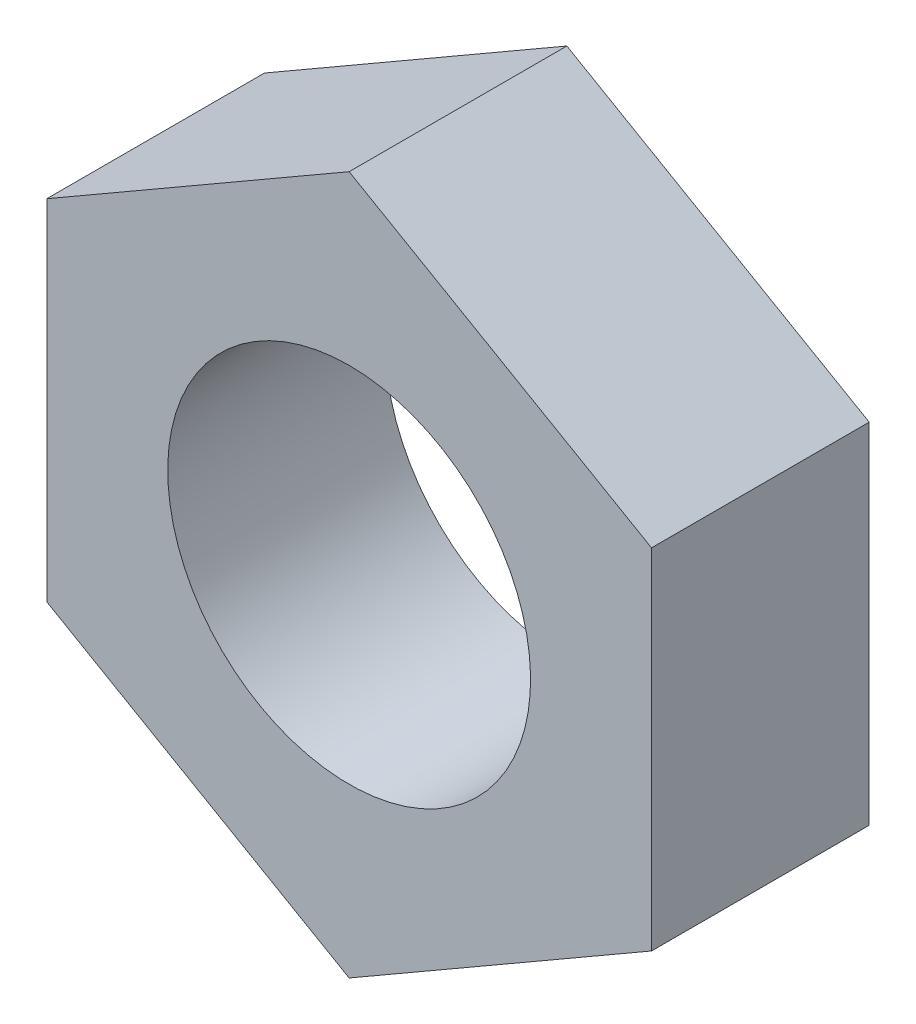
ISO-10303-21;
HEADER;
FILE_DESCRIPTION(('STEP AP214'),'2;1');
FILE_NAME('part.step','',(''),(''),'','','');
FILE_SCHEMA(('AUTOMOTIVE_DESIGN { 1 0 10303 214 1 1 1 1 }'));
ENDSEC;
DATA;
#1=APPLICATION_CONTEXT('core data for automotive mechanical design processes');
#2=APPLICATION_PROTOCOL_DEFINITION('international standard','automotive_design',2000,#1);
#3=PRODUCT_CONTEXT('',#1,'mechanical');
#4=PRODUCT('Part','Part','',(#3));
#5=PRODUCT_RELATED_PRODUCT_CATEGORY('part','',(#4));
#6=PRODUCT_DEFINITION_FORMATION('','',#4);
#7=PRODUCT_DEFINITION_CONTEXT('part definition',#1,'design');
#8=PRODUCT_DEFINITION('design','',#6,#7);
#9=PRODUCT_DEFINITION_SHAPE('','',#8);
#10=(LENGTH_UNIT() NAMED_UNIT(*) SI_UNIT(.MILLI.,.METRE.));
#11=(NAMED_UNIT(*) PLANE_ANGLE_UNIT() SI_UNIT($,.RADIAN.));
#12=(NAMED_UNIT(*) SI_UNIT($,.STERADIAN.) SOLID_ANGLE_UNIT());
#13=UNCERTAINTY_MEASURE_WITH_UNIT(LENGTH_MEASURE(1.E-05),#10,'distance_accuracy_value','');
#14=(GEOMETRIC_REPRESENTATION_CONTEXT(3) GLOBAL_UNCERTAINTY_ASSIGNED_CONTEXT((#13)) GLOBAL_UNIT_ASSIGNED_CONTEXT((#10,
#11,#12)) REPRESENTATION_CONTEXT('',''));
#15=CARTESIAN_POINT('',(0.,0.,0.));
#16=DIRECTION('',(0.,0.,1.));
#17=DIRECTION('',(1.,0.,0.));
#18=AXIS2_PLACEMENT_3D('',#15,#16,#17);
#19=CARTESIAN_POINT('',(5.,2.88675134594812,5.));
#20=DIRECTION('',(1.,0.,0.));
#21=DIRECTION('',(0.,0.,1.));
#22=AXIS2_PLACEMENT_3D('',#19,#20,#21);
#23=PLANE('',#22);
#24=DIRECTION('',(0.,1.,0.));
#25=VECTOR('',#24,1.);
#26=CARTESIAN_POINT('',(5.,2.88675134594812,3.6));
#27=LINE('',#26,#25);
#28=CARTESIAN_POINT('',(5.,-2.88675134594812,3.6));
#29=VERTEX_POINT('',#28);
#30=CARTESIAN_POINT('',(5.,2.88675134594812,3.6));
#31=VERTEX_POINT('',#30);
#32=EDGE_CURVE('E107',#29,#31,#27,.T.);
#33=ORIENTED_EDGE('',*,*,#32,.F.);
#34=DIRECTION('',(0.,0.,-1.));
#35=VECTOR('',#34,1.);
#36=CARTESIAN_POINT('',(5.,-2.88675134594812,5.));
#37=LINE('',#36,#35);
#38=CARTESIAN_POINT('',(5.,-2.88675134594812,0.));
#39=VERTEX_POINT('',#38);
#40=EDGE_CURVE('E39',#29,#39,#37,.T.);
#41=ORIENTED_EDGE('',*,*,#40,.T.);
#42=DIRECTION('',(0.,-1.,0.));
#43=VECTOR('',#42,1.);
#44=CARTESIAN_POINT('',(5.,2.88675134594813,0.));
#45=LINE('',#44,#43);
#46=CARTESIAN_POINT('',(5.,2.88675134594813,0.));
#47=VERTEX_POINT('',#46);
#48=EDGE_CURVE('E90',#47,#39,#45,.T.);
#49=ORIENTED_EDGE('',*,*,#48,.F.);
#50=DIRECTION('',(0.,0.,-1.));
#51=VECTOR('',#50,1.);
#52=CARTESIAN_POINT('',(5.,2.88675134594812,5.));
#53=LINE('',#52,#51);
#54=EDGE_CURVE('E9',#31,#47,#53,.T.);
#55=ORIENTED_EDGE('',*,*,#54,.F.);
#56=EDGE_LOOP('',(#33,#41,#49,#55));
#57=FACE_BOUND('',#56,.T.);
#58=ADVANCED_FACE('F14',(#57),#23,.T.);
#59=CARTESIAN_POINT('',(5.,2.88675134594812,5.));
#60=DIRECTION('',(-0.5,-0.86602540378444,0.));
#61=DIRECTION('',(0.86602540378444,-0.5,0.));
#62=AXIS2_PLACEMENT_3D('',#59,#60,#61);
#63=PLANE('',#62);
#64=DIRECTION('',(0.,0.,-1.));
#65=VECTOR('',#64,1.);
#66=CARTESIAN_POINT('',(0.,5.77350269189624,5.));
#67=LINE('',#66,#65);
#68=CARTESIAN_POINT('',(0.,5.77350269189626,3.6));
#69=VERTEX_POINT('',#68);
#70=CARTESIAN_POINT('',(0.,5.77350269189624,0.));
#71=VERTEX_POINT('',#70);
#72=EDGE_CURVE('E23',#69,#71,#67,.T.);
#73=ORIENTED_EDGE('',*,*,#72,.F.);
#74=DIRECTION('',(0.866025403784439,-0.5,0.));
#75=VECTOR('',#74,1.);
#76=CARTESIAN_POINT('',(5.,2.88675134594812,3.6));
#77=LINE('',#76,#75);
#78=EDGE_CURVE('E112',#69,#31,#77,.T.);
#79=ORIENTED_EDGE('',*,*,#78,.T.);
#80=ORIENTED_EDGE('',*,*,#54,.T.);
#81=DIRECTION('',(-0.86602540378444,0.5,0.));
#82=VECTOR('',#81,1.);
#83=CARTESIAN_POINT('',(5.,2.88675134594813,0.));
#84=LINE('',#83,#82);
#85=EDGE_CURVE('E85',#47,#71,#84,.T.);
#86=ORIENTED_EDGE('',*,*,#85,.T.);
#87=EDGE_LOOP('',(#73,#79,#80,#86));
#88=FACE_BOUND('',#87,.T.);
#89=ADVANCED_FACE('F16',(#88),#63,.F.);
#90=CARTESIAN_POINT('',(-5.,2.88675134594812,5.));
#91=DIRECTION('',(-0.5,0.86602540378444,0.));
#92=DIRECTION('',(-0.86602540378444,-0.5,0.));
#93=AXIS2_PLACEMENT_3D('',#90,#91,#92);
#94=PLANE('',#93);
#95=DIRECTION('',(-0.866025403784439,-0.5,0.));
#96=VECTOR('',#95,1.);
#97=CARTESIAN_POINT('',(-5.,2.88675134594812,3.6));
#98=LINE('',#97,#96);
#99=CARTESIAN_POINT('',(-5.,2.88675134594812,3.6));
#100=VERTEX_POINT('',#99);
#101=EDGE_CURVE('E99',#69,#100,#98,.T.);
#102=ORIENTED_EDGE('',*,*,#101,.F.);
#103=ORIENTED_EDGE('',*,*,#72,.T.);
#104=DIRECTION('',(0.86602540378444,0.5,0.));
#105=VECTOR('',#104,1.);
#106=CARTESIAN_POINT('',(-5.,2.88675134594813,0.));
#107=LINE('',#106,#105);
#108=CARTESIAN_POINT('',(-5.,2.88675134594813,0.));
#109=VERTEX_POINT('',#108);
#110=EDGE_CURVE('E83',#109,#71,#107,.T.);
#111=ORIENTED_EDGE('',*,*,#110,.F.);
#112=DIRECTION('',(0.,0.,-1.));
#113=VECTOR('',#112,1.);
#114=CARTESIAN_POINT('',(-5.,2.88675134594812,5.));
#115=LINE('',#114,#113);
#116=EDGE_CURVE('E68',#100,#109,#115,.T.);
#117=ORIENTED_EDGE('',*,*,#116,.F.);
#118=EDGE_LOOP('',(#102,#103,#111,#117));
#119=FACE_BOUND('',#118,.T.);
#120=ADVANCED_FACE('F96',(#119),#94,.T.);
#121=CARTESIAN_POINT('',(-5.,2.88675134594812,5.));
#122=DIRECTION('',(1.,0.,0.));
#123=DIRECTION('',(0.,0.,1.));
#124=AXIS2_PLACEMENT_3D('',#121,#122,#123);
#125=PLANE('',#124);
#126=DIRECTION('',(0.,0.,-1.));
#127=VECTOR('',#126,1.);
#128=CARTESIAN_POINT('',(-5.,-2.88675134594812,5.));
#129=LINE('',#128,#127);
#130=CARTESIAN_POINT('',(-5.,-2.88675134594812,3.6));
#131=VERTEX_POINT('',#130);
#132=CARTESIAN_POINT('',(-5.,-2.88675134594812,0.));
#133=VERTEX_POINT('',#132);
#134=EDGE_CURVE('E59',#131,#133,#129,.T.);
#135=ORIENTED_EDGE('',*,*,#134,.F.);
#136=DIRECTION('',(0.,1.,0.));
#137=VECTOR('',#136,1.);
#138=CARTESIAN_POINT('',(-5.,2.88675134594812,3.6));
#139=LINE('',#138,#137);
#140=EDGE_CURVE('E122',#131,#100,#139,.T.);
#141=ORIENTED_EDGE('',*,*,#140,.T.);
#142=ORIENTED_EDGE('',*,*,#116,.T.);
#143=DIRECTION('',(0.,-1.,0.));
#144=VECTOR('',#143,1.);
#145=CARTESIAN_POINT('',(-5.,2.88675134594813,0.));
#146=LINE('',#145,#144);
#147=EDGE_CURVE('E76',#109,#133,#146,.T.);
#148=ORIENTED_EDGE('',*,*,#147,.T.);
#149=EDGE_LOOP('',(#135,#141,#142,#148));
#150=FACE_BOUND('',#149,.T.);
#151=ADVANCED_FACE('F81',(#150),#125,.F.);
#152=CARTESIAN_POINT('',(-5.,-2.88675134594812,5.));
#153=DIRECTION('',(0.5,0.86602540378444,0.));
#154=DIRECTION('',(-0.86602540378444,0.5,0.));
#155=AXIS2_PLACEMENT_3D('',#152,#153,#154);
#156=PLANE('',#155);
#157=DIRECTION('',(0.,0.,-1.));
#158=VECTOR('',#157,1.);
#159=CARTESIAN_POINT('',(0.,-5.77350269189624,5.));
#160=LINE('',#159,#158);
#161=CARTESIAN_POINT('',(0.,-5.77350269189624,3.6));
#162=VERTEX_POINT('',#161);
#163=CARTESIAN_POINT('',(0.,-5.77350269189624,0.));
#164=VERTEX_POINT('',#163);
#165=EDGE_CURVE('E69',#162,#164,#160,.T.);
#166=ORIENTED_EDGE('',*,*,#165,.F.);
#167=DIRECTION('',(-0.866025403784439,0.5,0.));
#168=VECTOR('',#167,1.);
#169=CARTESIAN_POINT('',(-5.,-2.88675134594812,3.6));
#170=LINE('',#169,#168);
#171=EDGE_CURVE('E30',#162,#131,#170,.T.);
#172=ORIENTED_EDGE('',*,*,#171,.T.);
#173=ORIENTED_EDGE('',*,*,#134,.T.);
#174=DIRECTION('',(0.86602540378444,-0.5,0.));
#175=VECTOR('',#174,1.);
#176=CARTESIAN_POINT('',(-5.,-2.88675134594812,0.));
#177=LINE('',#176,#175);
#178=EDGE_CURVE('E63',#133,#164,#177,.T.);
#179=ORIENTED_EDGE('',*,*,#178,.T.);
#180=EDGE_LOOP('',(#166,#172,#173,#179));
#181=FACE_BOUND('',#180,.T.);
#182=ADVANCED_FACE('F62',(#181),#156,.F.);
#183=CARTESIAN_POINT('',(5.,-2.88675134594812,5.));
#184=DIRECTION('',(0.5,-0.86602540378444,0.));
#185=DIRECTION('',(0.86602540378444,0.5,0.));
#186=AXIS2_PLACEMENT_3D('',#183,#184,#185);
#187=PLANE('',#186);
#188=DIRECTION('',(0.866025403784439,0.5,0.));
#189=VECTOR('',#188,1.);
#190=CARTESIAN_POINT('',(5.,-2.88675134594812,3.6));
#191=LINE('',#190,#189);
#192=EDGE_CURVE('E120',#162,#29,#191,.T.);
#193=ORIENTED_EDGE('',*,*,#192,.F.);
#194=ORIENTED_EDGE('',*,*,#165,.T.);
#195=DIRECTION('',(-0.86602540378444,-0.5,0.));
#196=VECTOR('',#195,1.);
#197=CARTESIAN_POINT('',(5.,-2.88675134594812,0.));
#198=LINE('',#197,#196);
#199=EDGE_CURVE('E79',#39,#164,#198,.T.);
#200=ORIENTED_EDGE('',*,*,#199,.F.);
#201=ORIENTED_EDGE('',*,*,#40,.F.);
#202=EDGE_LOOP('',(#193,#194,#200,#201));
#203=FACE_BOUND('',#202,.T.);
#204=ADVANCED_FACE('F118',(#203),#187,.T.);
#205=CARTESIAN_POINT('',(5.,-8.66025403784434,0.));
#206=DIRECTION('',(0.,0.,1.));
#207=DIRECTION('',(0.,-1.,0.));
#208=AXIS2_PLACEMENT_3D('',#205,#206,#207);
#209=PLANE('',#208);
#210=CARTESIAN_POINT('',(0.,0.,0.));
#211=DIRECTION('',(0.,0.,-1.));
#212=DIRECTION('',(0.,1.,0.));
#213=AXIS2_PLACEMENT_3D('',#210,#211,#212);
#214=CIRCLE('',#213,3.);
#215=CARTESIAN_POINT('',(0.,3.,0.));
#216=VERTEX_POINT('',#215);
#217=EDGE_CURVE('E105',#216,#216,#214,.T.);
#218=ORIENTED_EDGE('',*,*,#217,.F.);
#219=EDGE_LOOP('',(#218));
#220=FACE_BOUND('',#219,.T.);
#221=ORIENTED_EDGE('',*,*,#48,.T.);
#222=ORIENTED_EDGE('',*,*,#199,.T.);
#223=ORIENTED_EDGE('',*,*,#178,.F.);
#224=ORIENTED_EDGE('',*,*,#147,.F.);
#225=ORIENTED_EDGE('',*,*,#110,.T.);
#226=ORIENTED_EDGE('',*,*,#85,.F.);
#227=EDGE_LOOP('',(#221,#222,#223,#224,#225,#226));
#228=FACE_BOUND('',#227,.T.);
#229=ADVANCED_FACE('F74',(#220,#228),#209,.F.);
#230=CARTESIAN_POINT('',(0.,0.,5.));
#231=DIRECTION('',(0.,0.,-1.));
#232=DIRECTION('',(0.,1.,0.));
#233=AXIS2_PLACEMENT_3D('',#230,#231,#232);
#234=CYLINDRICAL_SURFACE('',#233,3.);
#235=CARTESIAN_POINT('',(0.,0.,3.6));
#236=DIRECTION('',(0.,0.,-1.));
#237=DIRECTION('',(0.,1.,0.));
#238=AXIS2_PLACEMENT_3D('',#235,#236,#237);
#239=CIRCLE('',#238,3.);
#240=CARTESIAN_POINT('',(0.,3.,3.6));
#241=VERTEX_POINT('',#240);
#242=EDGE_CURVE('E18',#241,#241,#239,.F.);
#243=ORIENTED_EDGE('',*,*,#242,.T.);
#244=EDGE_LOOP('',(#243));
#245=FACE_BOUND('',#244,.T.);
#246=ORIENTED_EDGE('',*,*,#217,.T.);
#247=EDGE_LOOP('',(#246));
#248=FACE_BOUND('',#247,.T.);
#249=ADVANCED_FACE('F132',(#245,#248),#234,.F.);
#250=CARTESIAN_POINT('',(-10.,6.16668029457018,3.6));
#251=DIRECTION('',(0.,0.,-1.));
#252=DIRECTION('',(0.,1.,0.));
#253=AXIS2_PLACEMENT_3D('',#250,#251,#252);
#254=PLANE('',#253);
#255=ORIENTED_EDGE('',*,*,#32,.T.);
#256=ORIENTED_EDGE('',*,*,#78,.F.);
#257=ORIENTED_EDGE('',*,*,#101,.T.);
#258=ORIENTED_EDGE('',*,*,#140,.F.);
#259=ORIENTED_EDGE('',*,*,#171,.F.);
#260=ORIENTED_EDGE('',*,*,#192,.T.);
#261=EDGE_LOOP('',(#255,#256,#257,#258,#259,#260));
#262=FACE_BOUND('',#261,.T.);
#263=ORIENTED_EDGE('',*,*,#242,.F.);
#264=EDGE_LOOP('',(#263));
#265=FACE_BOUND('',#264,.T.);
#266=ADVANCED_FACE('F129',(#262,#265),#254,.F.);
#267=CLOSED_SHELL('',(#58,#89,#120,#151,#182,#204,#229,#249,#266));
#268=MANIFOLD_SOLID_BREP('B1',#267);
#269=ADVANCED_BREP_SHAPE_REPRESENTATION('',(#18,#268),#14);
#270=SHAPE_DEFINITION_REPRESENTATION(#9,#269);
ENDSEC;
END-ISO-10303-21;
